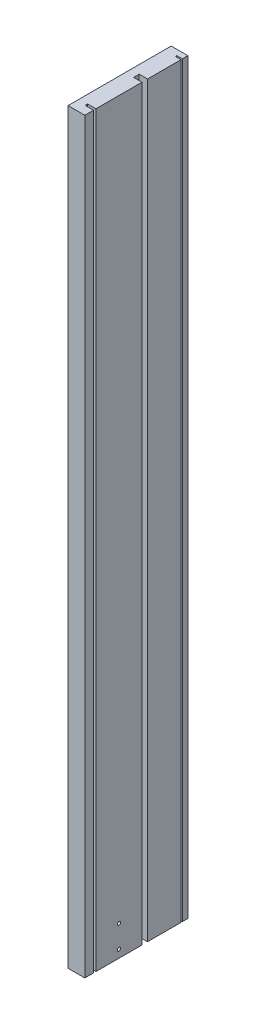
ISO-10303-21;
HEADER;
FILE_DESCRIPTION(('STEP AP214'),'2;1');
FILE_NAME('part.step','',(''),(''),'','','');
FILE_SCHEMA(('AUTOMOTIVE_DESIGN { 1 0 10303 214 1 1 1 1 }'));
ENDSEC;
DATA;
#1=APPLICATION_CONTEXT('core data for automotive mechanical design processes');
#2=APPLICATION_PROTOCOL_DEFINITION('international standard','automotive_design',2000,#1);
#3=PRODUCT_CONTEXT('',#1,'mechanical');
#4=PRODUCT('Part','Part','',(#3));
#5=PRODUCT_RELATED_PRODUCT_CATEGORY('part','',(#4));
#6=PRODUCT_DEFINITION_FORMATION('','',#4);
#7=PRODUCT_DEFINITION_CONTEXT('part definition',#1,'design');
#8=PRODUCT_DEFINITION('design','',#6,#7);
#9=PRODUCT_DEFINITION_SHAPE('','',#8);
#10=(LENGTH_UNIT() NAMED_UNIT(*) SI_UNIT(.MILLI.,.METRE.));
#11=(NAMED_UNIT(*) PLANE_ANGLE_UNIT() SI_UNIT($,.RADIAN.));
#12=(NAMED_UNIT(*) SI_UNIT($,.STERADIAN.) SOLID_ANGLE_UNIT());
#13=UNCERTAINTY_MEASURE_WITH_UNIT(LENGTH_MEASURE(1.E-05),#10,'distance_accuracy_value','');
#14=(GEOMETRIC_REPRESENTATION_CONTEXT(3) GLOBAL_UNCERTAINTY_ASSIGNED_CONTEXT((#13)) GLOBAL_UNIT_ASSIGNED_CONTEXT((#10,
#11,#12)) REPRESENTATION_CONTEXT('',''));
#15=CARTESIAN_POINT('',(0.,0.,0.));
#16=DIRECTION('',(0.,0.,1.));
#17=DIRECTION('',(1.,0.,0.));
#18=AXIS2_PLACEMENT_3D('',#15,#16,#17);
#19=CARTESIAN_POINT('',(19.05,0.,0.));
#20=DIRECTION('',(-1.,0.,0.));
#21=DIRECTION('',(0.,0.,1.));
#22=AXIS2_PLACEMENT_3D('',#19,#20,#21);
#23=PLANE('',#22);
#24=DIRECTION('',(0.,-1.,0.));
#25=VECTOR('',#24,1.);
#26=CARTESIAN_POINT('',(19.05,0.,0.));
#27=LINE('',#26,#25);
#28=CARTESIAN_POINT('',(19.05,1219.2,2.22044604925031E-13));
#29=VERTEX_POINT('',#28);
#30=CARTESIAN_POINT('',(19.05,-482.6,0.));
#31=VERTEX_POINT('',#30);
#32=EDGE_CURVE('E84',#29,#31,#27,.T.);
#33=ORIENTED_EDGE('',*,*,#32,.T.);
#34=DIRECTION('',(0.,0.,-1.));
#35=VECTOR('',#34,1.);
#36=CARTESIAN_POINT('',(19.05,-482.6,-19.8119999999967));
#37=LINE('',#36,#35);
#38=CARTESIAN_POINT('',(19.05,-482.6,-19.8119999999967));
#39=VERTEX_POINT('',#38);
#40=EDGE_CURVE('E179',#31,#39,#37,.T.);
#41=ORIENTED_EDGE('',*,*,#40,.T.);
#42=DIRECTION('',(0.,1.,0.));
#43=VECTOR('',#42,1.);
#44=CARTESIAN_POINT('',(19.05,0.,-19.8119999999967));
#45=LINE('',#44,#43);
#46=CARTESIAN_POINT('',(19.05,1219.2,-19.8119999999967));
#47=VERTEX_POINT('',#46);
#48=EDGE_CURVE('E98',#39,#47,#45,.T.);
#49=ORIENTED_EDGE('',*,*,#48,.T.);
#50=DIRECTION('',(0.,0.,1.));
#51=VECTOR('',#50,1.);
#52=CARTESIAN_POINT('',(19.05,1219.2,2.22044604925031E-13));
#53=LINE('',#52,#51);
#54=EDGE_CURVE('E62',#47,#29,#53,.T.);
#55=ORIENTED_EDGE('',*,*,#54,.T.);
#56=EDGE_LOOP('',(#33,#41,#49,#55));
#57=FACE_BOUND('',#56,.T.);
#58=ADVANCED_FACE('F38',(#57),#23,.F.);
#59=CARTESIAN_POINT('',(19.05,-414.02,-77.787499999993));
#60=DIRECTION('',(-1.,0.,0.));
#61=DIRECTION('',(0.,0.,1.));
#62=AXIS2_PLACEMENT_3D('',#59,#60,#61);
#63=CIRCLE('',#62,3.81);
#64=CARTESIAN_POINT('',(19.05,-414.02,-73.977499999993));
#65=VERTEX_POINT('',#64);
#66=EDGE_CURVE('E170',#65,#65,#63,.T.);
#67=ORIENTED_EDGE('',*,*,#66,.T.);
#68=EDGE_LOOP('',(#67));
#69=FACE_BOUND('',#68,.T.);
#70=CARTESIAN_POINT('',(19.05,-464.82,-77.787499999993));
#71=DIRECTION('',(-1.,0.,0.));
#72=DIRECTION('',(0.,0.,1.));
#73=AXIS2_PLACEMENT_3D('',#70,#71,#72);
#74=CIRCLE('',#73,3.81);
#75=CARTESIAN_POINT('',(19.05,-464.82,-73.977499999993));
#76=VERTEX_POINT('',#75);
#77=EDGE_CURVE('E211',#76,#76,#74,.T.);
#78=ORIENTED_EDGE('',*,*,#77,.T.);
#79=EDGE_LOOP('',(#78));
#80=FACE_BOUND('',#79,.T.);
#81=CARTESIAN_POINT('',(19.05,1219.2,-130.175));
#82=VERTEX_POINT('',#81);
#83=CARTESIAN_POINT('',(19.05,1219.2,-25.3999999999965));
#84=VERTEX_POINT('',#83);
#85=EDGE_CURVE('E354',#82,#84,#53,.T.);
#86=ORIENTED_EDGE('',*,*,#85,.T.);
#87=DIRECTION('',(0.,1.,0.));
#88=VECTOR('',#87,1.);
#89=CARTESIAN_POINT('',(19.05,0.,-25.3999999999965));
#90=LINE('',#89,#88);
#91=CARTESIAN_POINT('',(19.05,-482.6,-25.3999999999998));
#92=VERTEX_POINT('',#91);
#93=EDGE_CURVE('E150',#92,#84,#90,.T.);
#94=ORIENTED_EDGE('',*,*,#93,.F.);
#95=DIRECTION('',(0.,0.,-1.));
#96=VECTOR('',#95,1.);
#97=CARTESIAN_POINT('',(19.05,-482.6,-130.175));
#98=LINE('',#97,#96);
#99=CARTESIAN_POINT('',(19.05,-482.6,-130.175));
#100=VERTEX_POINT('',#99);
#101=EDGE_CURVE('E166',#92,#100,#98,.T.);
#102=ORIENTED_EDGE('',*,*,#101,.T.);
#103=DIRECTION('',(0.,1.,0.));
#104=VECTOR('',#103,1.);
#105=CARTESIAN_POINT('',(19.05,0.,-130.175));
#106=LINE('',#105,#104);
#107=EDGE_CURVE('E139',#100,#82,#106,.T.);
#108=ORIENTED_EDGE('',*,*,#107,.T.);
#109=EDGE_LOOP('',(#86,#94,#102,#108));
#110=FACE_BOUND('',#109,.T.);
#111=ADVANCED_FACE('F223',(#69,#80,#110),#23,.F.);
#112=CARTESIAN_POINT('',(19.05,1219.2,-234.95));
#113=VERTEX_POINT('',#112);
#114=CARTESIAN_POINT('',(19.05,1219.2,-222.25));
#115=VERTEX_POINT('',#114);
#116=EDGE_CURVE('E93',#113,#115,#53,.T.);
#117=ORIENTED_EDGE('',*,*,#116,.T.);
#118=DIRECTION('',(0.,1.,0.));
#119=VECTOR('',#118,1.);
#120=CARTESIAN_POINT('',(19.05,0.,-222.25));
#121=LINE('',#120,#119);
#122=CARTESIAN_POINT('',(19.05,-482.6,-222.25));
#123=VERTEX_POINT('',#122);
#124=EDGE_CURVE('E119',#123,#115,#121,.T.);
#125=ORIENTED_EDGE('',*,*,#124,.F.);
#126=DIRECTION('',(0.,0.,-1.));
#127=VECTOR('',#126,1.);
#128=CARTESIAN_POINT('',(19.05,-482.6,-234.95));
#129=LINE('',#128,#127);
#130=CARTESIAN_POINT('',(19.05,-482.6,-234.95));
#131=VERTEX_POINT('',#130);
#132=EDGE_CURVE('E188',#123,#131,#129,.T.);
#133=ORIENTED_EDGE('',*,*,#132,.T.);
#134=DIRECTION('',(0.,1.,0.));
#135=VECTOR('',#134,1.);
#136=CARTESIAN_POINT('',(19.05,0.,-234.95));
#137=LINE('',#136,#135);
#138=EDGE_CURVE('E107',#131,#113,#137,.T.);
#139=ORIENTED_EDGE('',*,*,#138,.T.);
#140=EDGE_LOOP('',(#117,#125,#133,#139));
#141=FACE_BOUND('',#140,.T.);
#142=ADVANCED_FACE('F258',(#141),#23,.F.);
#143=CARTESIAN_POINT('',(19.05,0.,0.));
#144=DIRECTION('',(0.,0.,-1.));
#145=DIRECTION('',(0.,1.,0.));
#146=AXIS2_PLACEMENT_3D('',#143,#144,#145);
#147=PLANE('',#146);
#148=DIRECTION('',(0.,-1.,0.));
#149=VECTOR('',#148,1.);
#150=CARTESIAN_POINT('',(-19.05,0.,0.));
#151=LINE('',#150,#149);
#152=CARTESIAN_POINT('',(-19.05,1219.2,2.22044604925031E-13));
#153=VERTEX_POINT('',#152);
#154=CARTESIAN_POINT('',(-19.05,-482.6,0.));
#155=VERTEX_POINT('',#154);
#156=EDGE_CURVE('E91',#153,#155,#151,.T.);
#157=ORIENTED_EDGE('',*,*,#156,.T.);
#158=DIRECTION('',(1.,0.,0.));
#159=VECTOR('',#158,1.);
#160=CARTESIAN_POINT('',(19.05,-482.6,0.));
#161=LINE('',#160,#159);
#162=EDGE_CURVE('E182',#155,#31,#161,.T.);
#163=ORIENTED_EDGE('',*,*,#162,.T.);
#164=ORIENTED_EDGE('',*,*,#32,.F.);
#165=DIRECTION('',(-1.,0.,0.));
#166=VECTOR('',#165,1.);
#167=CARTESIAN_POINT('',(19.05,1219.2,2.22044604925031E-13));
#168=LINE('',#167,#166);
#169=EDGE_CURVE('E46',#29,#153,#168,.T.);
#170=ORIENTED_EDGE('',*,*,#169,.T.);
#171=EDGE_LOOP('',(#157,#163,#164,#170));
#172=FACE_BOUND('',#171,.T.);
#173=ADVANCED_FACE('F40',(#172),#147,.F.);
#174=CARTESIAN_POINT('',(19.05,0.,-234.95));
#175=DIRECTION('',(0.,0.,1.));
#176=DIRECTION('',(0.,-1.,0.));
#177=AXIS2_PLACEMENT_3D('',#174,#175,#176);
#178=PLANE('',#177);
#179=DIRECTION('',(0.,1.,0.));
#180=VECTOR('',#179,1.);
#181=CARTESIAN_POINT('',(-19.05,0.,-234.95));
#182=LINE('',#181,#180);
#183=CARTESIAN_POINT('',(-19.05,-482.6,-234.95));
#184=VERTEX_POINT('',#183);
#185=CARTESIAN_POINT('',(-19.05,1219.2,-234.95));
#186=VERTEX_POINT('',#185);
#187=EDGE_CURVE('E85',#184,#186,#182,.T.);
#188=ORIENTED_EDGE('',*,*,#187,.T.);
#189=DIRECTION('',(-1.,0.,0.));
#190=VECTOR('',#189,1.);
#191=CARTESIAN_POINT('',(19.05,1219.2,-234.95));
#192=LINE('',#191,#190);
#193=EDGE_CURVE('E11',#113,#186,#192,.T.);
#194=ORIENTED_EDGE('',*,*,#193,.F.);
#195=ORIENTED_EDGE('',*,*,#138,.F.);
#196=DIRECTION('',(-1.,0.,0.));
#197=VECTOR('',#196,1.);
#198=CARTESIAN_POINT('',(-19.05,-482.6,-234.95));
#199=LINE('',#198,#197);
#200=EDGE_CURVE('E185',#131,#184,#199,.T.);
#201=ORIENTED_EDGE('',*,*,#200,.T.);
#202=EDGE_LOOP('',(#188,#194,#195,#201));
#203=FACE_BOUND('',#202,.T.);
#204=ADVANCED_FACE('F266',(#203),#178,.F.);
#205=CARTESIAN_POINT('',(19.05,1219.2,2.22044604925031E-13));
#206=DIRECTION('',(0.,-1.,0.));
#207=DIRECTION('',(0.,0.,-1.));
#208=AXIS2_PLACEMENT_3D('',#205,#206,#207);
#209=PLANE('',#208);
#210=ORIENTED_EDGE('',*,*,#54,.F.);
#211=DIRECTION('',(1.,0.,0.));
#212=VECTOR('',#211,1.);
#213=CARTESIAN_POINT('',(0.,1219.2,-19.8119999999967));
#214=LINE('',#213,#212);
#215=CARTESIAN_POINT('',(0.,1219.2,-19.8119999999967));
#216=VERTEX_POINT('',#215);
#217=EDGE_CURVE('E154',#216,#47,#214,.T.);
#218=ORIENTED_EDGE('',*,*,#217,.F.);
#219=DIRECTION('',(0.,0.,1.));
#220=VECTOR('',#219,1.);
#221=CARTESIAN_POINT('',(0.,1219.2,-25.3999999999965));
#222=LINE('',#221,#220);
#223=CARTESIAN_POINT('',(0.,1219.2,-25.3999999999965));
#224=VERTEX_POINT('',#223);
#225=EDGE_CURVE('E161',#224,#216,#222,.T.);
#226=ORIENTED_EDGE('',*,*,#225,.F.);
#227=DIRECTION('',(-1.,0.,0.));
#228=VECTOR('',#227,1.);
#229=CARTESIAN_POINT('',(19.05,1219.2,-25.3999999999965));
#230=LINE('',#229,#228);
#231=EDGE_CURVE('E132',#84,#224,#230,.T.);
#232=ORIENTED_EDGE('',*,*,#231,.F.);
#233=ORIENTED_EDGE('',*,*,#85,.F.);
#234=DIRECTION('',(1.,0.,0.));
#235=VECTOR('',#234,1.);
#236=CARTESIAN_POINT('',(0.,1219.2,-130.175));
#237=LINE('',#236,#235);
#238=CARTESIAN_POINT('',(0.,1219.2,-130.175));
#239=VERTEX_POINT('',#238);
#240=EDGE_CURVE('E129',#239,#82,#237,.T.);
#241=ORIENTED_EDGE('',*,*,#240,.F.);
#242=DIRECTION('',(0.,0.,1.));
#243=VECTOR('',#242,1.);
#244=CARTESIAN_POINT('',(0.,1219.2,-142.875));
#245=LINE('',#244,#243);
#246=CARTESIAN_POINT('',(0.,1219.2,-142.875));
#247=VERTEX_POINT('',#246);
#248=EDGE_CURVE('E136',#247,#239,#245,.T.);
#249=ORIENTED_EDGE('',*,*,#248,.F.);
#250=DIRECTION('',(-1.,0.,0.));
#251=VECTOR('',#250,1.);
#252=CARTESIAN_POINT('',(19.05,1219.2,-142.875));
#253=LINE('',#252,#251);
#254=CARTESIAN_POINT('',(19.05,1219.2,-142.875));
#255=VERTEX_POINT('',#254);
#256=EDGE_CURVE('E133',#255,#247,#253,.T.);
#257=ORIENTED_EDGE('',*,*,#256,.F.);
#258=CARTESIAN_POINT('',(19.05,1219.2,-219.075));
#259=VERTEX_POINT('',#258);
#260=EDGE_CURVE('E106',#259,#255,#53,.T.);
#261=ORIENTED_EDGE('',*,*,#260,.F.);
#262=DIRECTION('',(1.,0.,0.));
#263=VECTOR('',#262,1.);
#264=CARTESIAN_POINT('',(19.05,1219.2,-219.075));
#265=LINE('',#264,#263);
#266=CARTESIAN_POINT('',(6.35,1219.2,-219.075));
#267=VERTEX_POINT('',#266);
#268=EDGE_CURVE('E53',#267,#259,#265,.T.);
#269=ORIENTED_EDGE('',*,*,#268,.F.);
#270=DIRECTION('',(0.,0.,1.));
#271=VECTOR('',#270,1.);
#272=CARTESIAN_POINT('',(6.35,1219.2,-219.075));
#273=LINE('',#272,#271);
#274=CARTESIAN_POINT('',(6.35,1219.2,-222.25));
#275=VERTEX_POINT('',#274);
#276=EDGE_CURVE('E114',#275,#267,#273,.T.);
#277=ORIENTED_EDGE('',*,*,#276,.F.);
#278=DIRECTION('',(-1.,0.,0.));
#279=VECTOR('',#278,1.);
#280=CARTESIAN_POINT('',(6.35,1219.2,-222.25));
#281=LINE('',#280,#279);
#282=EDGE_CURVE('E110',#115,#275,#281,.T.);
#283=ORIENTED_EDGE('',*,*,#282,.F.);
#284=ORIENTED_EDGE('',*,*,#116,.F.);
#285=ORIENTED_EDGE('',*,*,#193,.T.);
#286=DIRECTION('',(0.,0.,1.));
#287=VECTOR('',#286,1.);
#288=CARTESIAN_POINT('',(-19.05,1219.2,2.22044604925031E-13));
#289=LINE('',#288,#287);
#290=EDGE_CURVE('E75',#186,#153,#289,.T.);
#291=ORIENTED_EDGE('',*,*,#290,.T.);
#292=ORIENTED_EDGE('',*,*,#169,.F.);
#293=EDGE_LOOP('',(#210,#218,#226,#232,#233,#241,#249,#257,#261,#269,#277,#283,#284,#285,#291,#292));
#294=FACE_BOUND('',#293,.T.);
#295=ADVANCED_FACE('F77',(#294),#209,.F.);
#296=ORIENTED_EDGE('',*,*,#260,.T.);
#297=DIRECTION('',(0.,1.,0.));
#298=VECTOR('',#297,1.);
#299=CARTESIAN_POINT('',(19.05,0.,-142.875));
#300=LINE('',#299,#298);
#301=CARTESIAN_POINT('',(19.05,-482.6,-142.875));
#302=VERTEX_POINT('',#301);
#303=EDGE_CURVE('E145',#302,#255,#300,.T.);
#304=ORIENTED_EDGE('',*,*,#303,.F.);
#305=DIRECTION('',(0.,0.,-1.));
#306=VECTOR('',#305,1.);
#307=CARTESIAN_POINT('',(19.05,-482.6,-219.075));
#308=LINE('',#307,#306);
#309=CARTESIAN_POINT('',(19.05,-482.6,-219.075));
#310=VERTEX_POINT('',#309);
#311=EDGE_CURVE('E200',#302,#310,#308,.T.);
#312=ORIENTED_EDGE('',*,*,#311,.T.);
#313=DIRECTION('',(0.,1.,0.));
#314=VECTOR('',#313,1.);
#315=CARTESIAN_POINT('',(19.05,0.,-219.075));
#316=LINE('',#315,#314);
#317=EDGE_CURVE('E122',#310,#259,#316,.T.);
#318=ORIENTED_EDGE('',*,*,#317,.T.);
#319=EDGE_LOOP('',(#296,#304,#312,#318));
#320=FACE_BOUND('',#319,.T.);
#321=ADVANCED_FACE('F236',(#320),#23,.F.);
#322=CARTESIAN_POINT('',(-19.05,0.,0.));
#323=DIRECTION('',(-1.,0.,0.));
#324=DIRECTION('',(0.,0.,1.));
#325=AXIS2_PLACEMENT_3D('',#322,#323,#324);
#326=PLANE('',#325);
#327=CARTESIAN_POINT('',(-19.05,-414.02,-77.787499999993));
#328=DIRECTION('',(-1.,0.,0.));
#329=DIRECTION('',(0.,0.,1.));
#330=AXIS2_PLACEMENT_3D('',#327,#328,#329);
#331=CIRCLE('',#330,3.81);
#332=CARTESIAN_POINT('',(-19.05,-414.02,-73.977499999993));
#333=VERTEX_POINT('',#332);
#334=EDGE_CURVE('E217',#333,#333,#331,.T.);
#335=ORIENTED_EDGE('',*,*,#334,.F.);
#336=EDGE_LOOP('',(#335));
#337=FACE_BOUND('',#336,.T.);
#338=CARTESIAN_POINT('',(-19.05,-464.82,-77.787499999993));
#339=DIRECTION('',(-1.,0.,0.));
#340=DIRECTION('',(0.,0.,1.));
#341=AXIS2_PLACEMENT_3D('',#338,#339,#340);
#342=CIRCLE('',#341,3.81);
#343=CARTESIAN_POINT('',(-19.05,-464.82,-73.977499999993));
#344=VERTEX_POINT('',#343);
#345=EDGE_CURVE('E214',#344,#344,#342,.T.);
#346=ORIENTED_EDGE('',*,*,#345,.F.);
#347=EDGE_LOOP('',(#346));
#348=FACE_BOUND('',#347,.T.);
#349=ORIENTED_EDGE('',*,*,#156,.F.);
#350=ORIENTED_EDGE('',*,*,#290,.F.);
#351=ORIENTED_EDGE('',*,*,#187,.F.);
#352=DIRECTION('',(0.,0.,1.));
#353=VECTOR('',#352,1.);
#354=CARTESIAN_POINT('',(-19.05,-482.6,0.));
#355=LINE('',#354,#353);
#356=EDGE_CURVE('E97',#184,#155,#355,.T.);
#357=ORIENTED_EDGE('',*,*,#356,.T.);
#358=EDGE_LOOP('',(#349,#350,#351,#357));
#359=FACE_BOUND('',#358,.T.);
#360=ADVANCED_FACE('F95',(#337,#348,#359),#326,.T.);
#361=CARTESIAN_POINT('',(6.35,0.,-222.25));
#362=DIRECTION('',(0.,0.,-1.));
#363=DIRECTION('',(-1.,0.,0.));
#364=AXIS2_PLACEMENT_3D('',#361,#362,#363);
#365=PLANE('',#364);
#366=ORIENTED_EDGE('',*,*,#282,.T.);
#367=DIRECTION('',(0.,1.,0.));
#368=VECTOR('',#367,1.);
#369=CARTESIAN_POINT('',(6.35,0.,-222.25));
#370=LINE('',#369,#368);
#371=CARTESIAN_POINT('',(6.35,-482.6,-222.25));
#372=VERTEX_POINT('',#371);
#373=EDGE_CURVE('E118',#372,#275,#370,.T.);
#374=ORIENTED_EDGE('',*,*,#373,.F.);
#375=DIRECTION('',(1.,0.,0.));
#376=VECTOR('',#375,1.);
#377=CARTESIAN_POINT('',(19.05,-482.6,-222.25));
#378=LINE('',#377,#376);
#379=EDGE_CURVE('E191',#372,#123,#378,.T.);
#380=ORIENTED_EDGE('',*,*,#379,.T.);
#381=ORIENTED_EDGE('',*,*,#124,.T.);
#382=EDGE_LOOP('',(#366,#374,#380,#381));
#383=FACE_BOUND('',#382,.T.);
#384=ADVANCED_FACE('F235',(#383),#365,.F.);
#385=CARTESIAN_POINT('',(19.05,0.,-219.075));
#386=DIRECTION('',(0.,0.,1.));
#387=DIRECTION('',(1.,0.,0.));
#388=AXIS2_PLACEMENT_3D('',#385,#386,#387);
#389=PLANE('',#388);
#390=ORIENTED_EDGE('',*,*,#268,.T.);
#391=ORIENTED_EDGE('',*,*,#317,.F.);
#392=DIRECTION('',(-1.,0.,0.));
#393=VECTOR('',#392,1.);
#394=CARTESIAN_POINT('',(6.35,-482.6,-219.075));
#395=LINE('',#394,#393);
#396=CARTESIAN_POINT('',(6.35,-482.6,-219.075));
#397=VERTEX_POINT('',#396);
#398=EDGE_CURVE('E197',#310,#397,#395,.T.);
#399=ORIENTED_EDGE('',*,*,#398,.T.);
#400=DIRECTION('',(0.,1.,0.));
#401=VECTOR('',#400,1.);
#402=CARTESIAN_POINT('',(6.35,0.,-219.075));
#403=LINE('',#402,#401);
#404=EDGE_CURVE('E125',#397,#267,#403,.T.);
#405=ORIENTED_EDGE('',*,*,#404,.T.);
#406=EDGE_LOOP('',(#390,#391,#399,#405));
#407=FACE_BOUND('',#406,.T.);
#408=ADVANCED_FACE('F385',(#407),#389,.F.);
#409=CARTESIAN_POINT('',(6.35,0.,-219.075));
#410=DIRECTION('',(-1.,0.,0.));
#411=DIRECTION('',(0.,0.,1.));
#412=AXIS2_PLACEMENT_3D('',#409,#410,#411);
#413=PLANE('',#412);
#414=ORIENTED_EDGE('',*,*,#276,.T.);
#415=ORIENTED_EDGE('',*,*,#404,.F.);
#416=DIRECTION('',(0.,0.,-1.));
#417=VECTOR('',#416,1.);
#418=CARTESIAN_POINT('',(6.35,-482.6,-222.25));
#419=LINE('',#418,#417);
#420=EDGE_CURVE('E194',#397,#372,#419,.T.);
#421=ORIENTED_EDGE('',*,*,#420,.T.);
#422=ORIENTED_EDGE('',*,*,#373,.T.);
#423=EDGE_LOOP('',(#414,#415,#421,#422));
#424=FACE_BOUND('',#423,.T.);
#425=ADVANCED_FACE('F381',(#424),#413,.F.);
#426=CARTESIAN_POINT('',(0.,0.,-130.175));
#427=DIRECTION('',(0.,0.,1.));
#428=DIRECTION('',(1.,0.,0.));
#429=AXIS2_PLACEMENT_3D('',#426,#427,#428);
#430=PLANE('',#429);
#431=ORIENTED_EDGE('',*,*,#240,.T.);
#432=ORIENTED_EDGE('',*,*,#107,.F.);
#433=DIRECTION('',(-1.,0.,0.));
#434=VECTOR('',#433,1.);
#435=CARTESIAN_POINT('',(0.,-482.6,-130.175));
#436=LINE('',#435,#434);
#437=CARTESIAN_POINT('',(0.,-482.6,-130.175));
#438=VERTEX_POINT('',#437);
#439=EDGE_CURVE('E169',#100,#438,#436,.T.);
#440=ORIENTED_EDGE('',*,*,#439,.T.);
#441=DIRECTION('',(0.,1.,0.));
#442=VECTOR('',#441,1.);
#443=CARTESIAN_POINT('',(0.,0.,-130.175));
#444=LINE('',#443,#442);
#445=EDGE_CURVE('E113',#438,#239,#444,.T.);
#446=ORIENTED_EDGE('',*,*,#445,.T.);
#447=EDGE_LOOP('',(#431,#432,#440,#446));
#448=FACE_BOUND('',#447,.T.);
#449=ADVANCED_FACE('F344',(#448),#430,.F.);
#450=CARTESIAN_POINT('',(0.,0.,-142.875));
#451=DIRECTION('',(-1.,0.,0.));
#452=DIRECTION('',(0.,0.,1.));
#453=AXIS2_PLACEMENT_3D('',#450,#451,#452);
#454=PLANE('',#453);
#455=ORIENTED_EDGE('',*,*,#248,.T.);
#456=ORIENTED_EDGE('',*,*,#445,.F.);
#457=DIRECTION('',(0.,0.,-1.));
#458=VECTOR('',#457,1.);
#459=CARTESIAN_POINT('',(0.,-482.6,-142.875));
#460=LINE('',#459,#458);
#461=CARTESIAN_POINT('',(0.,-482.6,-142.875));
#462=VERTEX_POINT('',#461);
#463=EDGE_CURVE('E206',#438,#462,#460,.T.);
#464=ORIENTED_EDGE('',*,*,#463,.T.);
#465=DIRECTION('',(0.,1.,0.));
#466=VECTOR('',#465,1.);
#467=CARTESIAN_POINT('',(0.,0.,-142.875));
#468=LINE('',#467,#466);
#469=EDGE_CURVE('E142',#462,#247,#468,.T.);
#470=ORIENTED_EDGE('',*,*,#469,.T.);
#471=EDGE_LOOP('',(#455,#456,#464,#470));
#472=FACE_BOUND('',#471,.T.);
#473=ADVANCED_FACE('F373',(#472),#454,.F.);
#474=CARTESIAN_POINT('',(19.05,0.,-142.875));
#475=DIRECTION('',(0.,0.,-1.));
#476=DIRECTION('',(-1.,0.,0.));
#477=AXIS2_PLACEMENT_3D('',#474,#475,#476);
#478=PLANE('',#477);
#479=ORIENTED_EDGE('',*,*,#256,.T.);
#480=ORIENTED_EDGE('',*,*,#469,.F.);
#481=DIRECTION('',(1.,0.,0.));
#482=VECTOR('',#481,1.);
#483=CARTESIAN_POINT('',(19.05,-482.6,-142.875));
#484=LINE('',#483,#482);
#485=EDGE_CURVE('E203',#462,#302,#484,.T.);
#486=ORIENTED_EDGE('',*,*,#485,.T.);
#487=ORIENTED_EDGE('',*,*,#303,.T.);
#488=EDGE_LOOP('',(#479,#480,#486,#487));
#489=FACE_BOUND('',#488,.T.);
#490=ADVANCED_FACE('F370',(#489),#478,.F.);
#491=CARTESIAN_POINT('',(0.,0.,-19.8119999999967));
#492=DIRECTION('',(0.,0.,1.));
#493=DIRECTION('',(1.,0.,0.));
#494=AXIS2_PLACEMENT_3D('',#491,#492,#493);
#495=PLANE('',#494);
#496=ORIENTED_EDGE('',*,*,#217,.T.);
#497=ORIENTED_EDGE('',*,*,#48,.F.);
#498=DIRECTION('',(-1.,0.,0.));
#499=VECTOR('',#498,1.);
#500=CARTESIAN_POINT('',(0.,-482.6,-19.8119999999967));
#501=LINE('',#500,#499);
#502=CARTESIAN_POINT('',(0.,-482.6,-19.8119999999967));
#503=VERTEX_POINT('',#502);
#504=EDGE_CURVE('E176',#39,#503,#501,.T.);
#505=ORIENTED_EDGE('',*,*,#504,.T.);
#506=DIRECTION('',(0.,1.,0.));
#507=VECTOR('',#506,1.);
#508=CARTESIAN_POINT('',(0.,0.,-19.8119999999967));
#509=LINE('',#508,#507);
#510=EDGE_CURVE('E101',#503,#216,#509,.T.);
#511=ORIENTED_EDGE('',*,*,#510,.T.);
#512=EDGE_LOOP('',(#496,#497,#505,#511));
#513=FACE_BOUND('',#512,.T.);
#514=ADVANCED_FACE('F364',(#513),#495,.F.);
#515=CARTESIAN_POINT('',(0.,0.,-25.3999999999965));
#516=DIRECTION('',(-1.,0.,0.));
#517=DIRECTION('',(0.,0.,1.));
#518=AXIS2_PLACEMENT_3D('',#515,#516,#517);
#519=PLANE('',#518);
#520=ORIENTED_EDGE('',*,*,#225,.T.);
#521=ORIENTED_EDGE('',*,*,#510,.F.);
#522=DIRECTION('',(0.,0.,-1.));
#523=VECTOR('',#522,1.);
#524=CARTESIAN_POINT('',(0.,-482.6,-25.3999999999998));
#525=LINE('',#524,#523);
#526=CARTESIAN_POINT('',(0.,-482.6,-25.3999999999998));
#527=VERTEX_POINT('',#526);
#528=EDGE_CURVE('E173',#503,#527,#525,.T.);
#529=ORIENTED_EDGE('',*,*,#528,.T.);
#530=DIRECTION('',(0.,1.,0.));
#531=VECTOR('',#530,1.);
#532=CARTESIAN_POINT('',(0.,0.,-25.3999999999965));
#533=LINE('',#532,#531);
#534=EDGE_CURVE('E153',#527,#224,#533,.T.);
#535=ORIENTED_EDGE('',*,*,#534,.T.);
#536=EDGE_LOOP('',(#520,#521,#529,#535));
#537=FACE_BOUND('',#536,.T.);
#538=ADVANCED_FACE('F360',(#537),#519,.F.);
#539=CARTESIAN_POINT('',(19.05,0.,-25.3999999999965));
#540=DIRECTION('',(0.,0.,-1.));
#541=DIRECTION('',(-1.,0.,0.));
#542=AXIS2_PLACEMENT_3D('',#539,#540,#541);
#543=PLANE('',#542);
#544=ORIENTED_EDGE('',*,*,#231,.T.);
#545=ORIENTED_EDGE('',*,*,#534,.F.);
#546=DIRECTION('',(1.,0.,0.));
#547=VECTOR('',#546,1.);
#548=CARTESIAN_POINT('',(19.05,-482.6,-25.3999999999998));
#549=LINE('',#548,#547);
#550=EDGE_CURVE('E123',#527,#92,#549,.T.);
#551=ORIENTED_EDGE('',*,*,#550,.T.);
#552=ORIENTED_EDGE('',*,*,#93,.T.);
#553=EDGE_LOOP('',(#544,#545,#551,#552));
#554=FACE_BOUND('',#553,.T.);
#555=ADVANCED_FACE('F247',(#554),#543,.F.);
#556=CARTESIAN_POINT('',(98.4249999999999,-482.6,-77.8509999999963));
#557=DIRECTION('',(0.,1.,0.));
#558=DIRECTION('',(1.,0.,0.));
#559=AXIS2_PLACEMENT_3D('',#556,#557,#558);
#560=PLANE('',#559);
#561=ORIENTED_EDGE('',*,*,#528,.F.);
#562=ORIENTED_EDGE('',*,*,#504,.F.);
#563=ORIENTED_EDGE('',*,*,#40,.F.);
#564=ORIENTED_EDGE('',*,*,#162,.F.);
#565=ORIENTED_EDGE('',*,*,#356,.F.);
#566=ORIENTED_EDGE('',*,*,#200,.F.);
#567=ORIENTED_EDGE('',*,*,#132,.F.);
#568=ORIENTED_EDGE('',*,*,#379,.F.);
#569=ORIENTED_EDGE('',*,*,#420,.F.);
#570=ORIENTED_EDGE('',*,*,#398,.F.);
#571=ORIENTED_EDGE('',*,*,#311,.F.);
#572=ORIENTED_EDGE('',*,*,#485,.F.);
#573=ORIENTED_EDGE('',*,*,#463,.F.);
#574=ORIENTED_EDGE('',*,*,#439,.F.);
#575=ORIENTED_EDGE('',*,*,#101,.F.);
#576=ORIENTED_EDGE('',*,*,#550,.F.);
#577=EDGE_LOOP('',(#561,#562,#563,#564,#565,#566,#567,#568,#569,#570,#571,#572,#573,#574,#575,#576));
#578=FACE_BOUND('',#577,.T.);
#579=ADVANCED_FACE('F241',(#578),#560,.F.);
#580=CARTESIAN_POINT('',(19.05,-464.82,-77.787499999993));
#581=DIRECTION('',(-1.,0.,0.));
#582=DIRECTION('',(0.,0.,1.));
#583=AXIS2_PLACEMENT_3D('',#580,#581,#582);
#584=CYLINDRICAL_SURFACE('',#583,3.81);
#585=CARTESIAN_POINT('',(19.05,-464.82,-73.977499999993));
#586=CARTESIAN_POINT('',(18.653125,-464.82,-73.977499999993));
#587=CARTESIAN_POINT('',(18.25625,-464.82,-73.977499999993));
#588=CARTESIAN_POINT('',(17.4625,-464.82,-73.977499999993));
#589=CARTESIAN_POINT('',(17.065625,-464.82,-73.977499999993));
#590=CARTESIAN_POINT('',(16.271875,-464.82,-73.977499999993));
#591=CARTESIAN_POINT('',(15.875,-464.82,-73.977499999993));
#592=CARTESIAN_POINT('',(15.08125,-464.82,-73.977499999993));
#593=CARTESIAN_POINT('',(14.684375,-464.82,-73.977499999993));
#594=CARTESIAN_POINT('',(13.890625,-464.82,-73.977499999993));
#595=CARTESIAN_POINT('',(13.49375,-464.82,-73.977499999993));
#596=CARTESIAN_POINT('',(12.7,-464.82,-73.977499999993));
#597=CARTESIAN_POINT('',(12.303125,-464.82,-73.977499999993));
#598=CARTESIAN_POINT('',(11.509375,-464.82,-73.977499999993));
#599=CARTESIAN_POINT('',(11.1125,-464.82,-73.977499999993));
#600=CARTESIAN_POINT('',(10.31875,-464.82,-73.977499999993));
#601=CARTESIAN_POINT('',(9.921875,-464.82,-73.977499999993));
#602=CARTESIAN_POINT('',(9.128125,-464.82,-73.977499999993));
#603=CARTESIAN_POINT('',(8.73125,-464.82,-73.977499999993));
#604=CARTESIAN_POINT('',(7.9375,-464.82,-73.977499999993));
#605=CARTESIAN_POINT('',(7.540625,-464.82,-73.977499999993));
#606=CARTESIAN_POINT('',(6.746875,-464.82,-73.977499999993));
#607=CARTESIAN_POINT('',(6.35,-464.82,-73.977499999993));
#608=CARTESIAN_POINT('',(5.55625,-464.82,-73.977499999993));
#609=CARTESIAN_POINT('',(5.159375,-464.82,-73.977499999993));
#610=CARTESIAN_POINT('',(4.365625,-464.82,-73.977499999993));
#611=CARTESIAN_POINT('',(3.96875,-464.82,-73.977499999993));
#612=CARTESIAN_POINT('',(3.175,-464.82,-73.977499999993));
#613=CARTESIAN_POINT('',(2.778125,-464.82,-73.977499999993));
#614=CARTESIAN_POINT('',(1.984375,-464.82,-73.977499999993));
#615=CARTESIAN_POINT('',(1.5875,-464.82,-73.977499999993));
#616=CARTESIAN_POINT('',(0.793750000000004,-464.82,-73.977499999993));
#617=CARTESIAN_POINT('',(0.396875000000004,-464.82,-73.977499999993));
#618=CARTESIAN_POINT('',(-0.396874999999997,-464.82,-73.977499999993));
#619=CARTESIAN_POINT('',(-0.793749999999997,-464.82,-73.977499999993));
#620=CARTESIAN_POINT('',(-1.5875,-464.82,-73.977499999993));
#621=CARTESIAN_POINT('',(-1.984375,-464.82,-73.977499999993));
#622=CARTESIAN_POINT('',(-2.778125,-464.82,-73.977499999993));
#623=CARTESIAN_POINT('',(-3.175,-464.82,-73.977499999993));
#624=CARTESIAN_POINT('',(-3.96875,-464.82,-73.977499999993));
#625=CARTESIAN_POINT('',(-4.365625,-464.82,-73.977499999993));
#626=CARTESIAN_POINT('',(-5.159375,-464.82,-73.977499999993));
#627=CARTESIAN_POINT('',(-5.55625,-464.82,-73.977499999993));
#628=CARTESIAN_POINT('',(-6.35,-464.82,-73.977499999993));
#629=CARTESIAN_POINT('',(-6.746875,-464.82,-73.977499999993));
#630=CARTESIAN_POINT('',(-7.540625,-464.82,-73.977499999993));
#631=CARTESIAN_POINT('',(-7.9375,-464.82,-73.977499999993));
#632=CARTESIAN_POINT('',(-8.73125,-464.82,-73.977499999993));
#633=CARTESIAN_POINT('',(-9.128125,-464.82,-73.977499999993));
#634=CARTESIAN_POINT('',(-9.921875,-464.82,-73.977499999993));
#635=CARTESIAN_POINT('',(-10.31875,-464.82,-73.977499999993));
#636=CARTESIAN_POINT('',(-11.1125,-464.82,-73.977499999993));
#637=CARTESIAN_POINT('',(-11.509375,-464.82,-73.977499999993));
#638=CARTESIAN_POINT('',(-12.303125,-464.82,-73.977499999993));
#639=CARTESIAN_POINT('',(-12.7,-464.82,-73.977499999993));
#640=CARTESIAN_POINT('',(-13.49375,-464.82,-73.977499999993));
#641=CARTESIAN_POINT('',(-13.890625,-464.82,-73.977499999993));
#642=CARTESIAN_POINT('',(-14.684375,-464.82,-73.977499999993));
#643=CARTESIAN_POINT('',(-15.08125,-464.82,-73.977499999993));
#644=CARTESIAN_POINT('',(-15.875,-464.82,-73.977499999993));
#645=CARTESIAN_POINT('',(-16.271875,-464.82,-73.977499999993));
#646=CARTESIAN_POINT('',(-17.065625,-464.82,-73.977499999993));
#647=CARTESIAN_POINT('',(-17.4625,-464.82,-73.977499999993));
#648=CARTESIAN_POINT('',(-18.25625,-464.82,-73.977499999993));
#649=CARTESIAN_POINT('',(-18.653125,-464.82,-73.977499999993));
#650=CARTESIAN_POINT('',(-19.05,-464.82,-73.977499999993));
#651=B_SPLINE_CURVE_WITH_KNOTS('',3,(#585,#586,#587,#588,#589,#590,#591,#592,#593,#594,#595,
#596,#597,#598,#599,#600,#601,#602,#603,#604,#605,#606,#607,#608,#609,#610,#611,#612,#613,#614,
#615,#616,#617,#618,#619,#620,#621,#622,#623,#624,#625,#626,#627,#628,#629,#630,#631,#632,#633,
#634,#635,#636,#637,#638,#639,#640,#641,#642,#643,#644,#645,#646,#647,#648,#649,#650),
.UNSPECIFIED.,.F.,.F.,(4,2,2,2,2,2,2,2,2,2,2,2,2,2,2,2,2,2,2,2,2,2,2,2,2,2,2,2,2,2,2,2,4),(0.,
1.190625,2.38125,3.571875,4.7625,5.953125,7.14375,8.334375,9.525,10.715625,11.90625,13.096875,
14.2875,15.478125,16.66875,17.859375,19.05,20.240625,21.43125,22.621875,23.8125,25.003125,
26.19375,27.384375,28.575,29.765625,30.95625,32.146875,33.3375,34.528125,35.71875,36.909375,
38.1),.UNSPECIFIED.);
#652=EDGE_CURVE('BSEAM229',#76,#344,#651,.T.);
#653=ORIENTED_EDGE('',*,*,#77,.F.);
#654=ORIENTED_EDGE('',*,*,#345,.T.);
#655=ORIENTED_EDGE('',*,*,#652,.T.);
#656=ORIENTED_EDGE('',*,*,#652,.F.);
#657=EDGE_LOOP('',(#653,#655,#654,#656));
#658=FACE_BOUND('',#657,.T.);
#659=ADVANCED_FACE('F229',(#658),#584,.F.);
#660=CARTESIAN_POINT('',(19.05,-414.02,-77.787499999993));
#661=DIRECTION('',(-1.,0.,0.));
#662=DIRECTION('',(0.,0.,1.));
#663=AXIS2_PLACEMENT_3D('',#660,#661,#662);
#664=CYLINDRICAL_SURFACE('',#663,3.81);
#665=CARTESIAN_POINT('',(19.05,-414.02,-73.977499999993));
#666=CARTESIAN_POINT('',(18.653125,-414.02,-73.977499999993));
#667=CARTESIAN_POINT('',(18.25625,-414.02,-73.977499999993));
#668=CARTESIAN_POINT('',(17.4625,-414.02,-73.977499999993));
#669=CARTESIAN_POINT('',(17.065625,-414.02,-73.977499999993));
#670=CARTESIAN_POINT('',(16.271875,-414.02,-73.977499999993));
#671=CARTESIAN_POINT('',(15.875,-414.02,-73.977499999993));
#672=CARTESIAN_POINT('',(15.08125,-414.02,-73.977499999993));
#673=CARTESIAN_POINT('',(14.684375,-414.02,-73.977499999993));
#674=CARTESIAN_POINT('',(13.890625,-414.02,-73.977499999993));
#675=CARTESIAN_POINT('',(13.49375,-414.02,-73.977499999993));
#676=CARTESIAN_POINT('',(12.7,-414.02,-73.977499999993));
#677=CARTESIAN_POINT('',(12.303125,-414.02,-73.977499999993));
#678=CARTESIAN_POINT('',(11.509375,-414.02,-73.977499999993));
#679=CARTESIAN_POINT('',(11.1125,-414.02,-73.977499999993));
#680=CARTESIAN_POINT('',(10.31875,-414.02,-73.977499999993));
#681=CARTESIAN_POINT('',(9.921875,-414.02,-73.977499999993));
#682=CARTESIAN_POINT('',(9.128125,-414.02,-73.977499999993));
#683=CARTESIAN_POINT('',(8.73125,-414.02,-73.977499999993));
#684=CARTESIAN_POINT('',(7.9375,-414.02,-73.977499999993));
#685=CARTESIAN_POINT('',(7.540625,-414.02,-73.977499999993));
#686=CARTESIAN_POINT('',(6.746875,-414.02,-73.977499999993));
#687=CARTESIAN_POINT('',(6.35,-414.02,-73.977499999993));
#688=CARTESIAN_POINT('',(5.55625,-414.02,-73.977499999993));
#689=CARTESIAN_POINT('',(5.159375,-414.02,-73.977499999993));
#690=CARTESIAN_POINT('',(4.365625,-414.02,-73.977499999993));
#691=CARTESIAN_POINT('',(3.96875,-414.02,-73.977499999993));
#692=CARTESIAN_POINT('',(3.175,-414.02,-73.977499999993));
#693=CARTESIAN_POINT('',(2.778125,-414.02,-73.977499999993));
#694=CARTESIAN_POINT('',(1.984375,-414.02,-73.977499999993));
#695=CARTESIAN_POINT('',(1.5875,-414.02,-73.977499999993));
#696=CARTESIAN_POINT('',(0.793750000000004,-414.02,-73.977499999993));
#697=CARTESIAN_POINT('',(0.396875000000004,-414.02,-73.977499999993));
#698=CARTESIAN_POINT('',(-0.396874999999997,-414.02,-73.977499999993));
#699=CARTESIAN_POINT('',(-0.793749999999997,-414.02,-73.977499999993));
#700=CARTESIAN_POINT('',(-1.5875,-414.02,-73.977499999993));
#701=CARTESIAN_POINT('',(-1.984375,-414.02,-73.977499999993));
#702=CARTESIAN_POINT('',(-2.778125,-414.02,-73.977499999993));
#703=CARTESIAN_POINT('',(-3.175,-414.02,-73.977499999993));
#704=CARTESIAN_POINT('',(-3.96875,-414.02,-73.977499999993));
#705=CARTESIAN_POINT('',(-4.365625,-414.02,-73.977499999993));
#706=CARTESIAN_POINT('',(-5.159375,-414.02,-73.977499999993));
#707=CARTESIAN_POINT('',(-5.55625,-414.02,-73.977499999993));
#708=CARTESIAN_POINT('',(-6.35,-414.02,-73.977499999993));
#709=CARTESIAN_POINT('',(-6.746875,-414.02,-73.977499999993));
#710=CARTESIAN_POINT('',(-7.540625,-414.02,-73.977499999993));
#711=CARTESIAN_POINT('',(-7.9375,-414.02,-73.977499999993));
#712=CARTESIAN_POINT('',(-8.73125,-414.02,-73.977499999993));
#713=CARTESIAN_POINT('',(-9.128125,-414.02,-73.977499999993));
#714=CARTESIAN_POINT('',(-9.921875,-414.02,-73.977499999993));
#715=CARTESIAN_POINT('',(-10.31875,-414.02,-73.977499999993));
#716=CARTESIAN_POINT('',(-11.1125,-414.02,-73.977499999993));
#717=CARTESIAN_POINT('',(-11.509375,-414.02,-73.977499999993));
#718=CARTESIAN_POINT('',(-12.303125,-414.02,-73.977499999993));
#719=CARTESIAN_POINT('',(-12.7,-414.02,-73.977499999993));
#720=CARTESIAN_POINT('',(-13.49375,-414.02,-73.977499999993));
#721=CARTESIAN_POINT('',(-13.890625,-414.02,-73.977499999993));
#722=CARTESIAN_POINT('',(-14.684375,-414.02,-73.977499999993));
#723=CARTESIAN_POINT('',(-15.08125,-414.02,-73.977499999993));
#724=CARTESIAN_POINT('',(-15.875,-414.02,-73.977499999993));
#725=CARTESIAN_POINT('',(-16.271875,-414.02,-73.977499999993));
#726=CARTESIAN_POINT('',(-17.065625,-414.02,-73.977499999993));
#727=CARTESIAN_POINT('',(-17.4625,-414.02,-73.977499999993));
#728=CARTESIAN_POINT('',(-18.25625,-414.02,-73.977499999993));
#729=CARTESIAN_POINT('',(-18.653125,-414.02,-73.977499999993));
#730=CARTESIAN_POINT('',(-19.05,-414.02,-73.977499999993));
#731=B_SPLINE_CURVE_WITH_KNOTS('',3,(#665,#666,#667,#668,#669,#670,#671,#672,#673,#674,#675,
#676,#677,#678,#679,#680,#681,#682,#683,#684,#685,#686,#687,#688,#689,#690,#691,#692,#693,#694,
#695,#696,#697,#698,#699,#700,#701,#702,#703,#704,#705,#706,#707,#708,#709,#710,#711,#712,#713,
#714,#715,#716,#717,#718,#719,#720,#721,#722,#723,#724,#725,#726,#727,#728,#729,#730),
.UNSPECIFIED.,.F.,.F.,(4,2,2,2,2,2,2,2,2,2,2,2,2,2,2,2,2,2,2,2,2,2,2,2,2,2,2,2,2,2,2,2,4),(0.,
1.190625,2.38125,3.571875,4.7625,5.953125,7.14375,8.334375,9.525,10.715625,11.90625,13.096875,
14.2875,15.478125,16.66875,17.859375,19.05,20.240625,21.43125,22.621875,23.8125,25.003125,
26.19375,27.384375,28.575,29.765625,30.95625,32.146875,33.3375,34.528125,35.71875,36.909375,
38.1),.UNSPECIFIED.);
#732=EDGE_CURVE('BSEAM226',#65,#333,#731,.T.);
#733=ORIENTED_EDGE('',*,*,#66,.F.);
#734=ORIENTED_EDGE('',*,*,#334,.T.);
#735=ORIENTED_EDGE('',*,*,#732,.T.);
#736=ORIENTED_EDGE('',*,*,#732,.F.);
#737=EDGE_LOOP('',(#733,#735,#734,#736));
#738=FACE_BOUND('',#737,.T.);
#739=ADVANCED_FACE('F226',(#738),#664,.F.);
#740=CLOSED_SHELL('',(#58,#111,#142,#173,#204,#295,#321,#360,#384,#408,#425,#449,#473,#490,#514,
#538,#555,#579,#659,#739));
#741=MANIFOLD_SOLID_BREP('B2',#740);
#742=ADVANCED_BREP_SHAPE_REPRESENTATION('',(#18,#741),#14);
#743=SHAPE_DEFINITION_REPRESENTATION(#9,#742);
ENDSEC;
END-ISO-10303-21;
